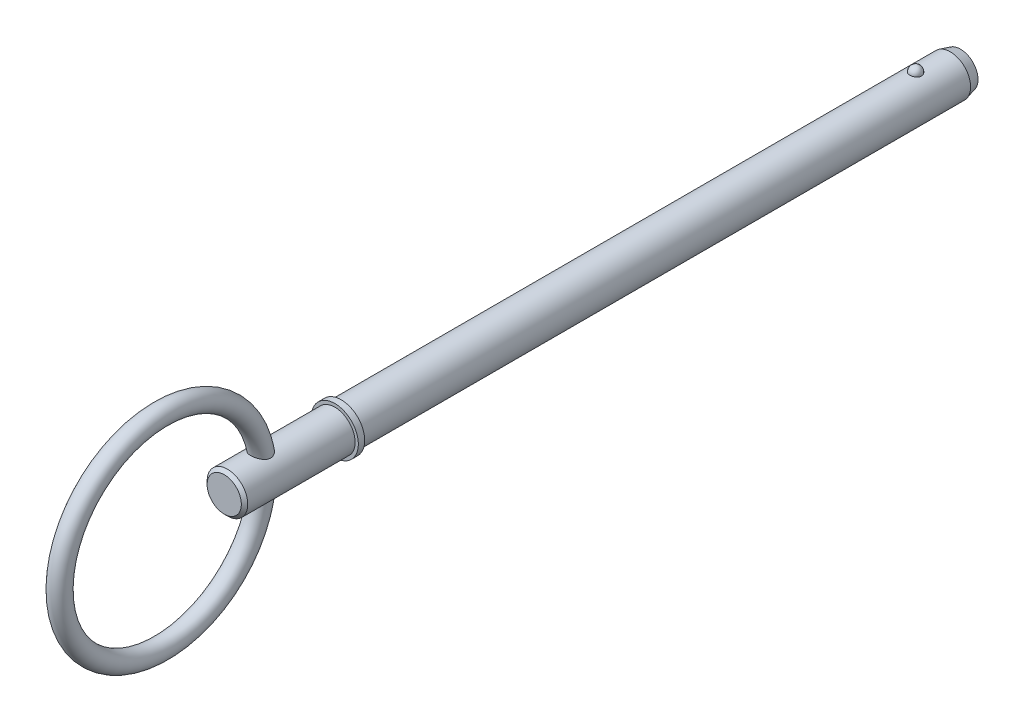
ISO-10303-21;
HEADER;
FILE_DESCRIPTION(('STEP AP214'),'2;1');
FILE_NAME('part.step','',(''),(''),'','','');
FILE_SCHEMA(('AUTOMOTIVE_DESIGN { 1 0 10303 214 1 1 1 1 }'));
ENDSEC;
DATA;
#1=APPLICATION_CONTEXT('core data for automotive mechanical design processes');
#2=APPLICATION_PROTOCOL_DEFINITION('international standard','automotive_design',2000,#1);
#3=PRODUCT_CONTEXT('',#1,'mechanical');
#4=PRODUCT('Part','Part','',(#3));
#5=PRODUCT_RELATED_PRODUCT_CATEGORY('part','',(#4));
#6=PRODUCT_DEFINITION_FORMATION('','',#4);
#7=PRODUCT_DEFINITION_CONTEXT('part definition',#1,'design');
#8=PRODUCT_DEFINITION('design','',#6,#7);
#9=PRODUCT_DEFINITION_SHAPE('','',#8);
#10=(LENGTH_UNIT() NAMED_UNIT(*) SI_UNIT(.MILLI.,.METRE.));
#11=(NAMED_UNIT(*) PLANE_ANGLE_UNIT() SI_UNIT($,.RADIAN.));
#12=(NAMED_UNIT(*) SI_UNIT($,.STERADIAN.) SOLID_ANGLE_UNIT());
#13=UNCERTAINTY_MEASURE_WITH_UNIT(LENGTH_MEASURE(1.E-05),#10,'distance_accuracy_value','');
#14=(GEOMETRIC_REPRESENTATION_CONTEXT(3) GLOBAL_UNCERTAINTY_ASSIGNED_CONTEXT((#13)) GLOBAL_UNIT_ASSIGNED_CONTEXT((#10,
#11,#12)) REPRESENTATION_CONTEXT('',''));
#15=CARTESIAN_POINT('',(0.,0.,0.));
#16=DIRECTION('',(0.,0.,1.));
#17=DIRECTION('',(1.,0.,0.));
#18=AXIS2_PLACEMENT_3D('',#15,#16,#17);
#19=CARTESIAN_POINT('',(0.,0.,88.9));
#20=DIRECTION('',(0.,0.,-1.));
#21=DIRECTION('',(-1.,0.,0.));
#22=AXIS2_PLACEMENT_3D('',#19,#20,#21);
#23=CYLINDRICAL_SURFACE('',#22,3.175);
#24=CARTESIAN_POINT('',(0.90060722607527,3.0445905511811,-0.910000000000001));
#25=CARTESIAN_POINT('',(0.90060646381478,3.04459122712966,-0.859144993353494));
#26=CARTESIAN_POINT('',(0.896466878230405,3.04582460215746,-0.808280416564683));
#27=CARTESIAN_POINT('',(0.88000740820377,3.05062019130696,-0.707994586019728));
#28=CARTESIAN_POINT('',(0.86768478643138,3.05418318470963,-0.658573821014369));
#29=CARTESIAN_POINT('',(0.835170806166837,3.06323316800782,-0.562604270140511));
#30=CARTESIAN_POINT('',(0.814982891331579,3.0687193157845,-0.516054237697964));
#31=CARTESIAN_POINT('',(0.767236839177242,3.08100268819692,-0.427093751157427));
#32=CARTESIAN_POINT('',(0.739678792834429,3.08779989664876,-0.384683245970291));
#33=CARTESIAN_POINT('',(0.677715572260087,3.10198953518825,-0.304951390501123));
#34=CARTESIAN_POINT('',(0.643275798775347,3.10938485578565,-0.267657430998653));
#35=CARTESIAN_POINT('',(0.568522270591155,3.12391647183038,-0.199446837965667));
#36=CARTESIAN_POINT('',(0.528208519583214,3.13105276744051,-0.168530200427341));
#37=CARTESIAN_POINT('',(0.442911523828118,3.14425008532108,-0.114021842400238));
#38=CARTESIAN_POINT('',(0.397942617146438,3.15031426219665,-0.0904084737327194));
#39=CARTESIAN_POINT('',(0.304493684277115,3.16071443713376,-0.051061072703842));
#40=CARTESIAN_POINT('',(0.256014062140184,3.1650506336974,-0.0353261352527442));
#41=CARTESIAN_POINT('',(0.15789136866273,3.17144549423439,-0.0124151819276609));
#42=CARTESIAN_POINT('',(0.108287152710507,3.1735453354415,-0.00508422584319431));
#43=CARTESIAN_POINT('',(0.0085070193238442,3.17538048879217,0.00133254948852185));
#44=CARTESIAN_POINT('',(-0.0416688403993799,3.17511603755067,0.000419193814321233));
#45=CARTESIAN_POINT('',(-0.140377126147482,3.17227395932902,-0.00954840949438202));
#46=CARTESIAN_POINT('',(-0.188922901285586,3.16973088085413,-0.0184810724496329));
#47=CARTESIAN_POINT('',(-0.283780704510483,3.16265029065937,-0.0440659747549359));
#48=CARTESIAN_POINT('',(-0.330092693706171,3.15811274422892,-0.0607183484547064));
#49=CARTESIAN_POINT('',(-0.419493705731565,3.1474895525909,-0.10140675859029));
#50=CARTESIAN_POINT('',(-0.462561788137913,3.14139480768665,-0.125486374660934));
#51=CARTESIAN_POINT('',(-0.54404237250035,3.12831396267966,-0.180346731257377));
#52=CARTESIAN_POINT('',(-0.582454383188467,3.12132776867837,-0.21112817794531));
#53=CARTESIAN_POINT('',(-0.654371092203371,3.10705591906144,-0.279257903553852));
#54=CARTESIAN_POINT('',(-0.687763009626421,3.09976707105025,-0.316724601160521));
#55=CARTESIAN_POINT('',(-0.747869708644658,3.08581767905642,-0.396782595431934));
#56=CARTESIAN_POINT('',(-0.774583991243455,3.07915718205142,-0.43937427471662));
#57=CARTESIAN_POINT('',(-0.820959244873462,3.06712152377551,-0.529074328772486));
#58=CARTESIAN_POINT('',(-0.840531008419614,3.06176288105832,-0.576231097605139));
#59=CARTESIAN_POINT('',(-0.871672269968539,3.0530437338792,-0.673291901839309));
#60=CARTESIAN_POINT('',(-0.883242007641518,3.04968316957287,-0.723195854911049));
#61=CARTESIAN_POINT('',(-0.898057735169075,3.04535343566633,-0.824104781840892));
#62=CARTESIAN_POINT('',(-0.901339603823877,3.04437395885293,-0.875104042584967));
#63=CARTESIAN_POINT('',(-0.89960137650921,3.04488803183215,-0.976947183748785));
#64=CARTESIAN_POINT('',(-0.894581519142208,3.04638151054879,-1.02779106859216));
#65=CARTESIAN_POINT('',(-0.876414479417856,3.051656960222,-1.12760218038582));
#66=CARTESIAN_POINT('',(-0.863310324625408,3.05542681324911,-1.17657789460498));
#67=CARTESIAN_POINT('',(-0.82933491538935,3.06482253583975,-1.27156757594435));
#68=CARTESIAN_POINT('',(-0.808463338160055,3.07044848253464,-1.31758141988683));
#69=CARTESIAN_POINT('',(-0.759325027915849,3.08296842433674,-1.40563218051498));
#70=CARTESIAN_POINT('',(-0.731017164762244,3.08986940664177,-1.44764515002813));
#71=CARTESIAN_POINT('',(-0.667767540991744,3.10415201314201,-1.52624913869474));
#72=CARTESIAN_POINT('',(-0.632825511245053,3.11153365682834,-1.56283993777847));
#73=CARTESIAN_POINT('',(-0.557049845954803,3.12598962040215,-1.62972906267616));
#74=CARTESIAN_POINT('',(-0.516193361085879,3.13306260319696,-1.66000181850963));
#75=CARTESIAN_POINT('',(-0.42979268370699,3.14607829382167,-1.7132172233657));
#76=CARTESIAN_POINT('',(-0.384248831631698,3.15202108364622,-1.73616040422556));
#77=CARTESIAN_POINT('',(-0.290370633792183,3.16204171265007,-1.77380927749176));
#78=CARTESIAN_POINT('',(-0.242079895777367,3.16614263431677,-1.7886174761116));
#79=CARTESIAN_POINT('',(-0.14357928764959,3.17213528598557,-1.81001390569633));
#80=CARTESIAN_POINT('',(-0.0933696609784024,3.1740272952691,-1.81660317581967));
#81=CARTESIAN_POINT('',(0.00648182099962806,3.17537830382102,-1.82132177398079));
#82=CARTESIAN_POINT('',(0.0561153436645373,3.17488455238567,-1.81961539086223));
#83=CARTESIAN_POINT('',(0.154368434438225,3.1716260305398,-1.80816900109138));
#84=CARTESIAN_POINT('',(0.202988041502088,3.16886134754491,-1.79842930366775));
#85=CARTESIAN_POINT('',(0.29764238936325,3.16137318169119,-1.77125024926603));
#86=CARTESIAN_POINT('',(0.343686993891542,3.15665785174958,-1.75384292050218));
#87=CARTESIAN_POINT('',(0.432167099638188,3.14576631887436,-1.71181408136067));
#88=CARTESIAN_POINT('',(0.474602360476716,3.13959001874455,-1.68719209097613));
#89=CARTESIAN_POINT('',(0.555408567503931,3.1263159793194,-1.63094218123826));
#90=CARTESIAN_POINT('',(0.593703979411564,3.11920512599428,-1.59920888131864));
#91=CARTESIAN_POINT('',(0.664472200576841,3.10490064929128,-1.52981493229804));
#92=CARTESIAN_POINT('',(0.696944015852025,3.09770701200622,-1.49215327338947));
#93=CARTESIAN_POINT('',(0.755798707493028,3.08388169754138,-1.41116434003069));
#94=CARTESIAN_POINT('',(0.782059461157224,3.07726269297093,-1.36774610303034));
#95=CARTESIAN_POINT('',(0.827051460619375,3.06547790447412,-1.27699966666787));
#96=CARTESIAN_POINT('',(0.845785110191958,3.06031165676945,-1.22967272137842));
#97=CARTESIAN_POINT('',(0.873798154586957,3.05242388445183,-1.13728658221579));
#98=CARTESIAN_POINT('',(0.883833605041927,3.04951005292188,-1.09247132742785));
#99=CARTESIAN_POINT('',(0.897238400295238,3.0455931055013,-1.00177329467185));
#100=CARTESIAN_POINT('',(0.900607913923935,3.0445899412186,-0.955890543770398));
#101=CARTESIAN_POINT('',(0.90060722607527,3.0445905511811,-0.910000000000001));
#102=B_SPLINE_CURVE_WITH_KNOTS('',3,(#24,#25,#26,#27,#28,#29,#30,#31,#32,#33,#34,#35,#36,#37,
#38,#39,#40,#41,#42,#43,#44,#45,#46,#47,#48,#49,#50,#51,#52,#53,#54,#55,#56,#57,#58,#59,#60,#61,
#62,#63,#64,#65,#66,#67,#68,#69,#70,#71,#72,#73,#74,#75,#76,#77,#78,#79,#80,#81,#82,#83,#84,#85,
#86,#87,#88,#89,#90,#91,#92,#93,#94,#95,#96,#97,#98,#99,#100,#101),.UNSPECIFIED.,.T.,.F.,(4,2,2,
2,2,2,2,2,2,2,2,2,2,2,2,2,2,2,2,2,2,2,2,2,2,2,2,2,2,2,2,2,2,2,2,2,2,2,4),(0.,0.152400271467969,
0.304851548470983,0.45723615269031,0.609618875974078,0.762787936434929,0.915956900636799,
1.06866739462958,1.22136034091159,1.37119044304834,1.52100555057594,1.66858689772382,
1.81617081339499,1.9646377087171,2.1131202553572,2.26455561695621,2.41600229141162,
2.5692805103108,2.72255413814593,2.87516308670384,3.02776764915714,3.1795669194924,
3.33137249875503,3.48403607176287,3.63670583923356,3.78998198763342,3.94324701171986,
4.09453370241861,4.24580126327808,4.39408543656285,4.5423639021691,4.69002878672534,
4.83770349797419,4.9877312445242,5.13778457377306,5.29058018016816,5.44332695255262,
5.58085340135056,5.71837636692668),.UNSPECIFIED.);
#103=CARTESIAN_POINT('',(0.90060722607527,3.0445905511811,-0.910000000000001));
#104=VERTEX_POINT('',#103);
#105=EDGE_CURVE('E101',#104,#104,#102,.T.);
#106=ORIENTED_EDGE('',*,*,#105,.T.);
#107=EDGE_LOOP('',(#106));
#108=FACE_BOUND('',#107,.T.);
#109=CARTESIAN_POINT('',(0.,0.,-6.33399999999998));
#110=DIRECTION('',(0.,0.,-1.));
#111=DIRECTION('',(-1.,0.,0.));
#112=AXIS2_PLACEMENT_3D('',#109,#110,#111);
#113=CIRCLE('',#112,3.175);
#114=CARTESIAN_POINT('',(-3.175,0.,-6.33399999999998));
#115=VERTEX_POINT('',#114);
#116=EDGE_CURVE('E109',#115,#115,#113,.F.);
#117=ORIENTED_EDGE('',*,*,#116,.T.);
#118=EDGE_LOOP('',(#117));
#119=FACE_BOUND('',#118,.T.);
#120=CARTESIAN_POINT('',(0.,0.,88.9));
#121=DIRECTION('',(0.,0.,1.));
#122=DIRECTION('',(1.,0.,0.));
#123=AXIS2_PLACEMENT_3D('',#120,#121,#122);
#124=CIRCLE('',#123,3.175);
#125=CARTESIAN_POINT('',(3.175,0.,88.9));
#126=VERTEX_POINT('',#125);
#127=EDGE_CURVE('E107',#126,#126,#124,.T.);
#128=ORIENTED_EDGE('',*,*,#127,.F.);
#129=EDGE_LOOP('',(#128));
#130=FACE_BOUND('',#129,.T.);
#131=ADVANCED_FACE('F39',(#108,#119,#130),#23,.T.);
#132=CARTESIAN_POINT('',(0.,0.,-7.92));
#133=DIRECTION('',(0.,0.,-1.));
#134=DIRECTION('',(-1.,0.,0.));
#135=AXIS2_PLACEMENT_3D('',#132,#133,#134);
#136=PLANE('',#135);
#137=CARTESIAN_POINT('',(0.,0.,-7.92));
#138=DIRECTION('',(0.,0.,-1.));
#139=DIRECTION('',(-1.,0.,0.));
#140=AXIS2_PLACEMENT_3D('',#137,#138,#139);
#141=CIRCLE('',#140,2.75003258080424);
#142=CARTESIAN_POINT('',(-2.75003258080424,0.,-7.92));
#143=VERTEX_POINT('',#142);
#144=EDGE_CURVE('E143',#143,#143,#141,.T.);
#145=ORIENTED_EDGE('',*,*,#144,.T.);
#146=EDGE_LOOP('',(#145));
#147=FACE_BOUND('',#146,.T.);
#148=ADVANCED_FACE('F87',(#147),#136,.T.);
#149=CARTESIAN_POINT('',(0.,0.,-7.92));
#150=DIRECTION('',(0.,0.,1.));
#151=DIRECTION('',(1.,0.,0.));
#152=AXIS2_PLACEMENT_3D('',#149,#150,#151);
#153=CONICAL_SURFACE('',#152,2.75003258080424,0.261799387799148);
#154=ORIENTED_EDGE('',*,*,#116,.F.);
#155=EDGE_LOOP('',(#154));
#156=FACE_BOUND('',#155,.T.);
#157=ORIENTED_EDGE('',*,*,#144,.F.);
#158=EDGE_LOOP('',(#157));
#159=FACE_BOUND('',#158,.T.);
#160=ADVANCED_FACE('F93',(#156,#159),#153,.T.);
#161=CARTESIAN_POINT('',(0.,3.175,-0.910000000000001));
#162=DIRECTION('',(0.,1.,0.));
#163=DIRECTION('',(0.,0.,-1.));
#164=AXIS2_PLACEMENT_3D('',#161,#162,#163);
#165=SPHERICAL_SURFACE('',#164,0.91);
#166=ORIENTED_EDGE('',*,*,#105,.F.);
#167=EDGE_LOOP('',(#166));
#168=FACE_BOUND('',#167,.T.);
#169=ADVANCED_FACE('F112',(#168),#165,.T.);
#170=CARTESIAN_POINT('',(0.,0.,88.9));
#171=DIRECTION('',(0.,0.,-1.));
#172=DIRECTION('',(-1.,0.,0.));
#173=AXIS2_PLACEMENT_3D('',#170,#171,#172);
#174=PLANE('',#173);
#175=ORIENTED_EDGE('',*,*,#127,.T.);
#176=EDGE_LOOP('',(#175));
#177=FACE_BOUND('',#176,.T.);
#178=CARTESIAN_POINT('',(0.,0.,88.9));
#179=DIRECTION('',(0.,0.,-1.));
#180=DIRECTION('',(-1.,0.,0.));
#181=AXIS2_PLACEMENT_3D('',#178,#179,#180);
#182=CIRCLE('',#181,3.675);
#183=CARTESIAN_POINT('',(-3.675,0.,88.9));
#184=VERTEX_POINT('',#183);
#185=EDGE_CURVE('E108',#184,#184,#182,.T.);
#186=ORIENTED_EDGE('',*,*,#185,.T.);
#187=EDGE_LOOP('',(#186));
#188=FACE_BOUND('',#187,.T.);
#189=ADVANCED_FACE('F116',(#177,#188),#174,.T.);
#190=CARTESIAN_POINT('',(0.,0.,33.7287874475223));
#191=DIRECTION('',(0.,0.,-1.));
#192=DIRECTION('',(-1.,0.,0.));
#193=AXIS2_PLACEMENT_3D('',#190,#191,#192);
#194=CYLINDRICAL_SURFACE('',#193,3.675);
#195=CARTESIAN_POINT('',(0.,0.,89.9));
#196=DIRECTION('',(0.,0.,-1.));
#197=DIRECTION('',(-1.,0.,0.));
#198=AXIS2_PLACEMENT_3D('',#195,#196,#197);
#199=CIRCLE('',#198,3.675);
#200=CARTESIAN_POINT('',(-3.675,0.,89.9));
#201=VERTEX_POINT('',#200);
#202=EDGE_CURVE('E133',#201,#201,#199,.T.);
#203=ORIENTED_EDGE('',*,*,#202,.T.);
#204=EDGE_LOOP('',(#203));
#205=FACE_BOUND('',#204,.T.);
#206=ORIENTED_EDGE('',*,*,#185,.F.);
#207=EDGE_LOOP('',(#206));
#208=FACE_BOUND('',#207,.T.);
#209=ADVANCED_FACE('F120',(#205,#208),#194,.T.);
#210=CARTESIAN_POINT('',(0.,3.675,89.9));
#211=DIRECTION('',(0.,0.,1.));
#212=DIRECTION('',(1.,0.,0.));
#213=AXIS2_PLACEMENT_3D('',#210,#211,#212);
#214=PLANE('',#213);
#215=CARTESIAN_POINT('',(0.,0.,89.9));
#216=DIRECTION('',(0.,0.,1.));
#217=DIRECTION('',(1.,0.,0.));
#218=AXIS2_PLACEMENT_3D('',#215,#216,#217);
#219=CIRCLE('',#218,3.175);
#220=CARTESIAN_POINT('',(3.175,0.,89.9));
#221=VERTEX_POINT('',#220);
#222=EDGE_CURVE('E111',#221,#221,#219,.T.);
#223=ORIENTED_EDGE('',*,*,#222,.F.);
#224=EDGE_LOOP('',(#223));
#225=FACE_BOUND('',#224,.T.);
#226=ORIENTED_EDGE('',*,*,#202,.F.);
#227=EDGE_LOOP('',(#226));
#228=FACE_BOUND('',#227,.T.);
#229=ADVANCED_FACE('F84',(#225,#228),#214,.T.);
#230=CARTESIAN_POINT('',(0.,0.,107.19));
#231=DIRECTION('',(0.,0.,-1.));
#232=DIRECTION('',(-1.,0.,0.));
#233=AXIS2_PLACEMENT_3D('',#230,#231,#232);
#234=CYLINDRICAL_SURFACE('',#233,3.175);
#235=CARTESIAN_POINT('',(-0.793622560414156,-3.07421343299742,100.194961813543));
#236=CARTESIAN_POINT('',(-0.723928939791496,-3.09220199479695,100.154074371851));
#237=CARTESIAN_POINT('',(-0.650537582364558,-3.10860299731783,100.118657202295));
#238=CARTESIAN_POINT('',(-0.498225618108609,-3.13662262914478,100.05960803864));
#239=CARTESIAN_POINT('',(-0.41929921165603,-3.14823615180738,100.035988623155));
#240=CARTESIAN_POINT('',(-0.258022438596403,-3.16553731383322,100.001178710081));
#241=CARTESIAN_POINT('',(-0.175668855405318,-3.17121924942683,99.9900001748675));
#242=CARTESIAN_POINT('',(-0.010058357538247,-3.17606405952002,99.9804538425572));
#243=CARTESIAN_POINT('',(0.0731982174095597,-3.17522930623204,99.9820813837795));
#244=CARTESIAN_POINT('',(0.236345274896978,-3.16722178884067,99.9979075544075));
#245=CARTESIAN_POINT('',(0.316269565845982,-3.16018772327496,100.011831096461));
#246=CARTESIAN_POINT('',(0.472429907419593,-3.14064183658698,100.051487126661));
#247=CARTESIAN_POINT('',(0.548665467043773,-3.12812928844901,100.077221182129));
#248=CARTESIAN_POINT('',(0.696533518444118,-3.0985857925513,100.140314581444));
#249=CARTESIAN_POINT('',(0.768085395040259,-3.08149328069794,100.177833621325));
#250=CARTESIAN_POINT('',(0.903666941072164,-3.04449595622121,100.263584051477));
#251=CARTESIAN_POINT('',(0.967693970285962,-3.02459016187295,100.311819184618));
#252=CARTESIAN_POINT('',(1.08889306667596,-2.98315111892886,100.420085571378));
#253=CARTESIAN_POINT('',(1.14572430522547,-2.96158491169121,100.48048692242));
#254=CARTESIAN_POINT('',(1.24806454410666,-2.91993487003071,100.610687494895));
#255=CARTESIAN_POINT('',(1.29357550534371,-2.89985077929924,100.680485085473));
#256=CARTESIAN_POINT('',(1.37094214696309,-2.86407549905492,100.82626000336));
#257=CARTESIAN_POINT('',(1.40307792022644,-2.84829687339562,100.902066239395));
#258=CARTESIAN_POINT('',(1.45397574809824,-2.82265933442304,101.058955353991));
#259=CARTESIAN_POINT('',(1.47274938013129,-2.81279529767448,101.140033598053));
#260=CARTESIAN_POINT('',(1.49549698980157,-2.80076108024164,101.297902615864));
#261=CARTESIAN_POINT('',(1.50056337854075,-2.79802369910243,101.374495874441));
#262=CARTESIAN_POINT('',(1.49933665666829,-2.79868066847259,101.527554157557));
#263=CARTESIAN_POINT('',(1.49304097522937,-2.80207640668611,101.604019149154));
#264=CARTESIAN_POINT('',(1.46976618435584,-2.81435249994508,101.755280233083));
#265=CARTESIAN_POINT('',(1.45272287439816,-2.82326580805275,101.83006347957));
#266=CARTESIAN_POINT('',(1.40884990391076,-2.84541139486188,101.976008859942));
#267=CARTESIAN_POINT('',(1.38201642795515,-2.85864535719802,102.047169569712));
#268=CARTESIAN_POINT('',(1.31496449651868,-2.89016475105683,102.194607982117));
#269=CARTESIAN_POINT('',(1.27338339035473,-2.9089013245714,102.270169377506));
#270=CARTESIAN_POINT('',(1.17952729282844,-2.94820796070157,102.41390343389));
#271=CARTESIAN_POINT('',(1.12723913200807,-2.96878026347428,102.482066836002));
#272=CARTESIAN_POINT('',(1.00570728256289,-3.01228109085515,102.617310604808));
#273=CARTESIAN_POINT('',(0.935174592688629,-3.03519170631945,102.683249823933));
#274=CARTESIAN_POINT('',(0.782605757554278,-3.07805054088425,102.801321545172));
#275=CARTESIAN_POINT('',(0.700588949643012,-3.09800362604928,102.853476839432));
#276=CARTESIAN_POINT('',(0.54900367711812,-3.12787153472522,102.929642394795));
#277=CARTESIAN_POINT('',(0.481582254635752,-3.1390487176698,102.957437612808));
#278=CARTESIAN_POINT('',(0.342696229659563,-3.15722518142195,103.002156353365));
#279=CARTESIAN_POINT('',(0.27123564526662,-3.16422853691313,103.019090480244));
#280=CARTESIAN_POINT('',(0.125873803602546,-3.17334230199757,103.041062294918));
#281=CARTESIAN_POINT('',(0.0519637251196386,-3.17543249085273,103.046050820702));
#282=CARTESIAN_POINT('',(-0.0956207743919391,-3.17441743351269,103.043618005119));
#283=CARTESIAN_POINT('',(-0.169295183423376,-3.1713119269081,103.036196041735));
#284=CARTESIAN_POINT('',(-0.309449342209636,-3.16061694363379,103.010337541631));
#285=CARTESIAN_POINT('',(-0.376089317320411,-3.15332372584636,102.992627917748));
#286=CARTESIAN_POINT('',(-0.505583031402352,-3.13517004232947,102.947787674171));
#287=CARTESIAN_POINT('',(-0.568435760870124,-3.12430863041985,102.920654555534));
#288=CARTESIAN_POINT('',(-0.694306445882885,-3.09887452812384,102.855562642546));
#289=CARTESIAN_POINT('',(-0.756907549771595,-3.08406907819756,102.816893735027));
#290=CARTESIAN_POINT('',(-0.875645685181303,-3.05248288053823,102.731345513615));
#291=CARTESIAN_POINT('',(-0.931779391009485,-3.03570112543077,102.684462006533));
#292=CARTESIAN_POINT('',(-1.0463923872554,-2.99832170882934,102.57479262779));
#293=CARTESIAN_POINT('',(-1.10353654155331,-2.97757338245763,102.510660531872));
#294=CARTESIAN_POINT('',(-1.20755858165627,-2.93692907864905,102.374226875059));
#295=CARTESIAN_POINT('',(-1.25442453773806,-2.91703411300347,102.301915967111));
#296=CARTESIAN_POINT('',(-1.34199791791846,-2.87788786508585,102.141279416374));
#297=CARTESIAN_POINT('',(-1.38127718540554,-2.85900475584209,102.052074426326));
#298=CARTESIAN_POINT('',(-1.44406659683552,-2.82781619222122,101.867183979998));
#299=CARTESIAN_POINT('',(-1.46759319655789,-2.81550387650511,101.771505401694));
#300=CARTESIAN_POINT('',(-1.49571801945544,-2.8006591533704,101.584577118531));
#301=CARTESIAN_POINT('',(-1.50169726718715,-2.79741422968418,101.493598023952));
#302=CARTESIAN_POINT('',(-1.49747735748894,-2.79967890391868,101.312156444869));
#303=CARTESIAN_POINT('',(-1.48729863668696,-2.80517744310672,101.221693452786));
#304=CARTESIAN_POINT('',(-1.45348639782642,-2.82281521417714,101.058462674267));
#305=CARTESIAN_POINT('',(-1.43212237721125,-2.83382344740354,100.985088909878));
#306=CARTESIAN_POINT('',(-1.37828411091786,-2.86039426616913,100.843390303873));
#307=CARTESIAN_POINT('',(-1.34580440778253,-2.87595908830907,100.775067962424));
#308=CARTESIAN_POINT('',(-1.27066760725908,-2.90993532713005,100.645033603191));
#309=CARTESIAN_POINT('',(-1.22800357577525,-2.9283486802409,100.583326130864));
#310=CARTESIAN_POINT('',(-1.13363307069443,-2.96615489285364,100.467708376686));
#311=CARTESIAN_POINT('',(-1.08193541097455,-2.98554678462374,100.413790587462));
#312=CARTESIAN_POINT('',(-0.990573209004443,-3.01675653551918,100.33230940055));
#313=CARTESIAN_POINT('',(-0.953209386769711,-3.02880489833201,100.302213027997));
#314=CARTESIAN_POINT('',(-0.875544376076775,-3.0521621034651,100.245747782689));
#315=CARTESIAN_POINT('',(-0.835242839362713,-3.06347085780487,100.219379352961));
#316=CARTESIAN_POINT('',(-0.793622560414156,-3.07421343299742,100.194961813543));
#317=B_SPLINE_CURVE_WITH_KNOTS('',3,(#235,#236,#237,#238,#239,#240,#241,#242,#243,#244,#245,
#246,#247,#248,#249,#250,#251,#252,#253,#254,#255,#256,#257,#258,#259,#260,#261,#262,#263,#264,
#265,#266,#267,#268,#269,#270,#271,#272,#273,#274,#275,#276,#277,#278,#279,#280,#281,#282,#283,
#284,#285,#286,#287,#288,#289,#290,#291,#292,#293,#294,#295,#296,#297,#298,#299,#300,#301,#302,
#303,#304,#305,#306,#307,#308,#309,#310,#311,#312,#313,#314,#315,#316),.UNSPECIFIED.,.T.,.F.,(4,
2,2,2,2,2,2,2,2,2,2,2,2,2,2,2,2,2,2,2,2,2,2,2,2,2,2,2,2,2,2,2,2,2,2,2,2,2,2,2,4),(0.,
0.248167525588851,0.496599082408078,0.745269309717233,0.99384902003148,1.23700449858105,
1.48019225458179,1.72682894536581,1.97355191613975,2.22939388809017,2.48519151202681,
2.73532416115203,2.98523982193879,3.21455414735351,3.44392036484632,3.67466984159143,
3.90550934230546,4.16925064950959,4.43331832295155,4.72951976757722,5.02522832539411,
5.24564983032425,5.46585579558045,5.68696647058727,5.90808822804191,6.11521387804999,
6.32239449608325,6.54672206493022,6.77116447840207,7.03522663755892,7.29959368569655,
7.59590092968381,7.89189815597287,8.163876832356,8.43551178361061,8.66603557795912,
8.89667271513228,9.1274673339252,9.35803801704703,9.50622339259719,9.6544263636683),.UNSPECIFIED.);
#318=CARTESIAN_POINT('',(-0.793622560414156,-3.07421343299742,100.194961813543));
#319=VERTEX_POINT('',#318);
#320=EDGE_CURVE('E10',#319,#319,#317,.T.);
#321=ORIENTED_EDGE('',*,*,#320,.F.);
#322=EDGE_LOOP('',(#321));
#323=FACE_BOUND('',#322,.T.);
#324=CARTESIAN_POINT('',(-0.793622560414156,3.07421343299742,100.194961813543));
#325=CARTESIAN_POINT('',(-0.86460683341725,3.05588589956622,100.236612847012));
#326=CARTESIAN_POINT('',(-0.931875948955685,3.03587991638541,100.28401145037));
#327=CARTESIAN_POINT('',(-1.05725170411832,2.99453227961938,100.389377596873));
#328=CARTESIAN_POINT('',(-1.11534118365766,2.97318822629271,100.447364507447));
#329=CARTESIAN_POINT('',(-1.22080462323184,2.93146441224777,100.572887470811));
#330=CARTESIAN_POINT('',(-1.26816209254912,2.91108617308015,100.640437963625));
#331=CARTESIAN_POINT('',(-1.35052787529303,2.87380473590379,100.783508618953));
#332=CARTESIAN_POINT('',(-1.38554886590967,2.85689797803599,100.859020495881));
#333=CARTESIAN_POINT('',(-1.44074287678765,2.82945202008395,101.012294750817));
#334=CARTESIAN_POINT('',(-1.46153301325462,2.81865228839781,101.089787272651));
#335=CARTESIAN_POINT('',(-1.49023441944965,2.80358650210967,101.247720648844));
#336=CARTESIAN_POINT('',(-1.49815016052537,2.79931817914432,101.328160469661));
#337=CARTESIAN_POINT('',(-1.50117056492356,2.79769676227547,101.484007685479));
#338=CARTESIAN_POINT('',(-1.49708260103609,2.79990784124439,101.55939856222));
#339=CARTESIAN_POINT('',(-1.4784698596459,2.80977909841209,101.70849830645));
#340=CARTESIAN_POINT('',(-1.46394166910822,2.8174410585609,101.782206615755));
#341=CARTESIAN_POINT('',(-1.42400377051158,2.83784609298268,101.93134437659));
#342=CARTESIAN_POINT('',(-1.39791960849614,2.85090002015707,102.006548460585));
#343=CARTESIAN_POINT('',(-1.33585690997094,2.8805017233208,102.152038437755));
#344=CARTESIAN_POINT('',(-1.29987052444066,2.89705226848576,102.222320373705));
#345=CARTESIAN_POINT('',(-1.21229019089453,2.93489412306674,102.367740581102));
#346=CARTESIAN_POINT('',(-1.15911759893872,2.95651988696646,102.441844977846));
#347=CARTESIAN_POINT('',(-1.04143166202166,2.99999612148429,102.580380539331));
#348=CARTESIAN_POINT('',(-0.976918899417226,3.0218465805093,102.644812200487));
#349=CARTESIAN_POINT('',(-0.845368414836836,3.06106710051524,102.75523022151));
#350=CARTESIAN_POINT('',(-0.77946649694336,3.0786636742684,102.802484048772));
#351=CARTESIAN_POINT('',(-0.640261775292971,3.11059085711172,102.885954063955));
#352=CARTESIAN_POINT('',(-0.566963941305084,3.12492363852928,102.922177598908));
#353=CARTESIAN_POINT('',(-0.413802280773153,3.14887886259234,102.981810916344));
#354=CARTESIAN_POINT('',(-0.333888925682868,3.15846114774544,103.005111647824));
#355=CARTESIAN_POINT('',(-0.170660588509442,3.17146222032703,103.036571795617));
#356=CARTESIAN_POINT('',(-0.0873493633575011,3.17488763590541,103.044747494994));
#357=CARTESIAN_POINT('',(0.0674621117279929,3.17509166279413,103.045231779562));
#358=CARTESIAN_POINT('',(0.138963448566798,3.17274321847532,103.039624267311));
#359=CARTESIAN_POINT('',(0.27985527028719,3.16342998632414,103.017158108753));
#360=CARTESIAN_POINT('',(0.349245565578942,3.15646478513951,103.000298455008));
#361=CARTESIAN_POINT('',(0.483013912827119,3.13875920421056,102.956711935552));
#362=CARTESIAN_POINT('',(0.54745548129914,3.12808257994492,102.9301513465));
#363=CARTESIAN_POINT('',(0.671431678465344,3.10383639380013,102.868378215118));
#364=CARTESIAN_POINT('',(0.73096479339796,3.09026594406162,102.833163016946));
#365=CARTESIAN_POINT('',(0.852308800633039,3.0591902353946,102.749871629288));
#366=CARTESIAN_POINT('',(0.91328416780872,3.04140021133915,102.700687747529));
#367=CARTESIAN_POINT('',(1.0273242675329,3.00480015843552,102.59418506));
#368=CARTESIAN_POINT('',(1.08038247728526,2.98598930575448,102.536859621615));
#369=CARTESIAN_POINT('',(1.18657794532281,2.94557646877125,102.404695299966));
#370=CARTESIAN_POINT('',(1.23812372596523,2.92405810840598,102.32854450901));
#371=CARTESIAN_POINT('',(1.32862928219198,2.88406370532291,102.16827960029));
#372=CARTESIAN_POINT('',(1.36758013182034,2.86558982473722,102.084159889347));
#373=CARTESIAN_POINT('',(1.43274280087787,2.83359383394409,101.9061421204));
#374=CARTESIAN_POINT('',(1.45837682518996,2.82030175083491,101.811986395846));
#375=CARTESIAN_POINT('',(1.49241322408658,2.80245006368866,101.619849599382));
#376=CARTESIAN_POINT('',(1.50084951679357,2.79787327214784,101.521876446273));
#377=CARTESIAN_POINT('',(1.49914798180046,2.7987793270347,101.340507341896));
#378=CARTESIAN_POINT('',(1.49154990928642,2.80288682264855,101.257078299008));
#379=CARTESIAN_POINT('',(1.46253136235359,2.81813655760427,101.09332287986));
#380=CARTESIAN_POINT('',(1.44111368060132,2.82927737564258,101.012995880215));
#381=CARTESIAN_POINT('',(1.38785163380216,2.85574398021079,100.865720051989));
#382=CARTESIAN_POINT('',(1.3572264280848,2.87055627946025,100.798230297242));
#383=CARTESIAN_POINT('',(1.28612163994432,2.90310901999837,100.669444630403));
#384=CARTESIAN_POINT('',(1.24564038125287,2.92084995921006,100.608149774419));
#385=CARTESIAN_POINT('',(1.1532082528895,2.95860856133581,100.489475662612));
#386=CARTESIAN_POINT('',(1.10072548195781,2.97869868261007,100.432534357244));
#387=CARTESIAN_POINT('',(0.987118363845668,3.01825121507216,100.327770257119));
#388=CARTESIAN_POINT('',(0.925990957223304,3.03771340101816,100.279950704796));
#389=CARTESIAN_POINT('',(0.792065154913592,3.07545294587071,100.191357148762));
#390=CARTESIAN_POINT('',(0.718757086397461,3.09356121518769,100.151278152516));
#391=CARTESIAN_POINT('',(0.565747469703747,3.12516438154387,100.083373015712));
#392=CARTESIAN_POINT('',(0.486046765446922,3.13865988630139,100.05554526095));
#393=CARTESIAN_POINT('',(0.323293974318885,3.15955163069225,100.013089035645));
#394=CARTESIAN_POINT('',(0.240283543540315,3.16700771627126,99.9983309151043));
#395=CARTESIAN_POINT('',(0.072630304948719,3.17527774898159,99.9819853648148));
#396=CARTESIAN_POINT('',(-0.0120126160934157,3.17609123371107,99.9803988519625));
#397=CARTESIAN_POINT('',(-0.177340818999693,3.17108555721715,99.9902649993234));
#398=CARTESIAN_POINT('',(-0.258061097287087,3.16549698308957,100.001264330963));
#399=CARTESIAN_POINT('',(-0.416230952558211,3.1486007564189,100.035250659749));
#400=CARTESIAN_POINT('',(-0.493684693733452,3.13730063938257,100.058221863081));
#401=CARTESIAN_POINT('',(-0.607599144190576,3.11657538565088,100.101836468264));
#402=CARTESIAN_POINT('',(-0.64599981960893,3.10882447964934,100.118369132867));
#403=CARTESIAN_POINT('',(-0.721122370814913,3.092262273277,100.154435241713));
#404=CARTESIAN_POINT('',(-0.757844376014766,3.08345105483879,100.17396845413));
#405=CARTESIAN_POINT('',(-0.793622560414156,3.07421343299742,100.194961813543));
#406=B_SPLINE_CURVE_WITH_KNOTS('',3,(#324,#325,#326,#327,#328,#329,#330,#331,#332,#333,#334,
#335,#336,#337,#338,#339,#340,#341,#342,#343,#344,#345,#346,#347,#348,#349,#350,#351,#352,#353,
#354,#355,#356,#357,#358,#359,#360,#361,#362,#363,#364,#365,#366,#367,#368,#369,#370,#371,#372,
#373,#374,#375,#376,#377,#378,#379,#380,#381,#382,#383,#384,#385,#386,#387,#388,#389,#390,#391,
#392,#393,#394,#395,#396,#397,#398,#399,#400,#401,#402,#403,#404,#405),.UNSPECIFIED.,.T.,.F.,(4,
2,2,2,2,2,2,2,2,2,2,2,2,2,2,2,2,2,2,2,2,2,2,2,2,2,2,2,2,2,2,2,2,2,2,2,2,2,2,2,4),(0.,
0.252800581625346,0.506068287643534,0.75972256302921,1.01311541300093,1.25467278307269,
1.49614624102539,1.72175790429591,1.94744335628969,2.18851823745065,2.42978476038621,
2.7098131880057,2.98982723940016,3.23776482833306,3.48553690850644,3.73536921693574,
3.98493240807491,4.19913817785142,4.41336312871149,4.62407643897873,4.83485449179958,
5.07495869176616,5.31525962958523,5.59735778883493,5.87965543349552,6.17335015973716,
6.46646508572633,6.71664398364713,6.96677234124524,7.19253107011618,7.41832822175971,
7.6573166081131,7.89638978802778,8.15162793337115,8.40683243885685,8.65947601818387,
8.91213718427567,9.15597668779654,9.39949531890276,9.5269241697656,9.65434318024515),.UNSPECIFIED.);
#407=CARTESIAN_POINT('',(-0.793622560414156,3.07421343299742,100.194961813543));
#408=VERTEX_POINT('',#407);
#409=EDGE_CURVE('E51',#408,#408,#406,.T.);
#410=ORIENTED_EDGE('',*,*,#409,.F.);
#411=EDGE_LOOP('',(#410));
#412=FACE_BOUND('',#411,.T.);
#413=CARTESIAN_POINT('',(0.,0.,106.69));
#414=DIRECTION('',(0.,0.,-1.));
#415=DIRECTION('',(-1.,0.,0.));
#416=AXIS2_PLACEMENT_3D('',#413,#414,#415);
#417=CIRCLE('',#416,3.175);
#418=CARTESIAN_POINT('',(-3.175,0.,106.69));
#419=VERTEX_POINT('',#418);
#420=EDGE_CURVE('E63',#419,#419,#417,.T.);
#421=ORIENTED_EDGE('',*,*,#420,.T.);
#422=EDGE_LOOP('',(#421));
#423=FACE_BOUND('',#422,.T.);
#424=ORIENTED_EDGE('',*,*,#222,.T.);
#425=EDGE_LOOP('',(#424));
#426=FACE_BOUND('',#425,.T.);
#427=ADVANCED_FACE('F68',(#323,#412,#423,#426),#234,.T.);
#428=CARTESIAN_POINT('',(0.,0.,107.19));
#429=DIRECTION('',(0.,0.,-1.));
#430=DIRECTION('',(-1.,0.,0.));
#431=AXIS2_PLACEMENT_3D('',#428,#429,#430);
#432=PLANE('',#431);
#433=CARTESIAN_POINT('',(0.,0.,107.19));
#434=DIRECTION('',(0.,0.,-1.));
#435=DIRECTION('',(-1.,0.,0.));
#436=AXIS2_PLACEMENT_3D('',#433,#434,#435);
#437=CIRCLE('',#436,2.67499999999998);
#438=CARTESIAN_POINT('',(-2.67499999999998,0.,107.19));
#439=VERTEX_POINT('',#438);
#440=EDGE_CURVE('E57',#439,#439,#437,.F.);
#441=ORIENTED_EDGE('',*,*,#440,.T.);
#442=EDGE_LOOP('',(#441));
#443=FACE_BOUND('',#442,.T.);
#444=ADVANCED_FACE('F75',(#443),#432,.F.);
#445=CARTESIAN_POINT('',(0.,0.,106.69));
#446=DIRECTION('',(0.,0.,-1.));
#447=DIRECTION('',(-1.,0.,0.));
#448=AXIS2_PLACEMENT_3D('',#445,#446,#447);
#449=CONICAL_SURFACE('',#448,3.175,0.785398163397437);
#450=ORIENTED_EDGE('',*,*,#440,.F.);
#451=EDGE_LOOP('',(#450));
#452=FACE_BOUND('',#451,.T.);
#453=ORIENTED_EDGE('',*,*,#420,.F.);
#454=EDGE_LOOP('',(#453));
#455=FACE_BOUND('',#454,.T.);
#456=ADVANCED_FACE('F41',(#452,#455),#449,.T.);
#457=CARTESIAN_POINT('',(0.,0.,117.065));
#458=DIRECTION('',(1.,0.,0.));
#459=DIRECTION('',(0.,0.,-1.));
#460=AXIS2_PLACEMENT_3D('',#457,#458,#459);
#461=TOROIDAL_SURFACE('',#460,15.875,1.5);
#462=ORIENTED_EDGE('',*,*,#320,.T.);
#463=EDGE_LOOP('',(#462));
#464=FACE_BOUND('',#463,.T.);
#465=ORIENTED_EDGE('',*,*,#409,.T.);
#466=EDGE_LOOP('',(#465));
#467=FACE_BOUND('',#466,.T.);
#468=ADVANCED_FACE('F72',(#464,#467),#461,.T.);
#469=CLOSED_SHELL('',(#131,#148,#160,#169,#189,#209,#229,#427,#444,#456,#468));
#470=MANIFOLD_SOLID_BREP('B2',#469);
#471=ADVANCED_BREP_SHAPE_REPRESENTATION('',(#18,#470),#14);
#472=SHAPE_DEFINITION_REPRESENTATION(#9,#471);
ENDSEC;
END-ISO-10303-21;
